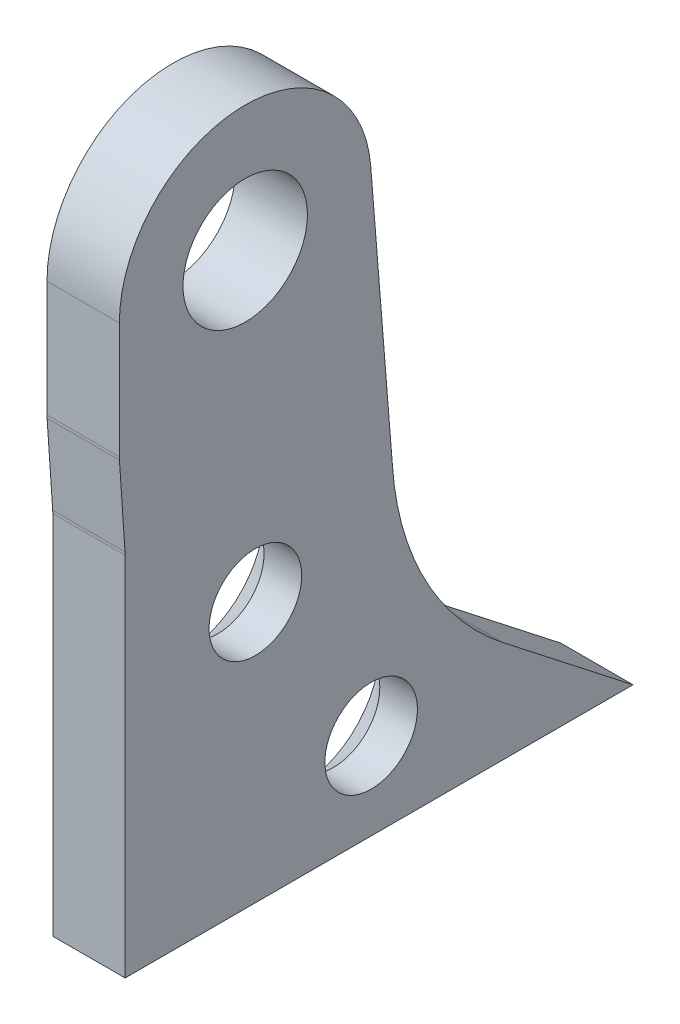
ISO-10303-21;
HEADER;
FILE_DESCRIPTION(('STEP AP214'),'2;1');
FILE_NAME('part.step','',(''),(''),'','','');
FILE_SCHEMA(('AUTOMOTIVE_DESIGN { 1 0 10303 214 1 1 1 1 }'));
ENDSEC;
DATA;
#1=APPLICATION_CONTEXT('core data for automotive mechanical design processes');
#2=APPLICATION_PROTOCOL_DEFINITION('international standard','automotive_design',2000,#1);
#3=PRODUCT_CONTEXT('',#1,'mechanical');
#4=PRODUCT('Part','Part','',(#3));
#5=PRODUCT_RELATED_PRODUCT_CATEGORY('part','',(#4));
#6=PRODUCT_DEFINITION_FORMATION('','',#4);
#7=PRODUCT_DEFINITION_CONTEXT('part definition',#1,'design');
#8=PRODUCT_DEFINITION('design','',#6,#7);
#9=PRODUCT_DEFINITION_SHAPE('','',#8);
#10=(LENGTH_UNIT() NAMED_UNIT(*) SI_UNIT(.MILLI.,.METRE.));
#11=(NAMED_UNIT(*) PLANE_ANGLE_UNIT() SI_UNIT($,.RADIAN.));
#12=(NAMED_UNIT(*) SI_UNIT($,.STERADIAN.) SOLID_ANGLE_UNIT());
#13=UNCERTAINTY_MEASURE_WITH_UNIT(LENGTH_MEASURE(1.E-05),#10,'distance_accuracy_value','');
#14=(GEOMETRIC_REPRESENTATION_CONTEXT(3) GLOBAL_UNCERTAINTY_ASSIGNED_CONTEXT((#13)) GLOBAL_UNIT_ASSIGNED_CONTEXT((#10,
#11,#12)) REPRESENTATION_CONTEXT('',''));
#15=CARTESIAN_POINT('',(0.,0.,0.));
#16=DIRECTION('',(0.,0.,1.));
#17=DIRECTION('',(1.,0.,0.));
#18=AXIS2_PLACEMENT_3D('',#15,#16,#17);
#19=CARTESIAN_POINT('',(-1.25,0.,0.));
#20=DIRECTION('',(-1.,0.,0.));
#21=DIRECTION('',(0.,0.,-1.));
#22=AXIS2_PLACEMENT_3D('',#19,#20,#21);
#23=PLANE('',#22);
#24=CARTESIAN_POINT('',(-1.25,-16.7,-4.35));
#25=DIRECTION('',(1.,0.,0.));
#26=DIRECTION('',(0.,0.,-1.));
#27=AXIS2_PLACEMENT_3D('',#24,#25,#26);
#28=CIRCLE('',#27,2.80000000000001);
#29=CARTESIAN_POINT('',(-1.25,-16.7,-7.15000000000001));
#30=VERTEX_POINT('',#29);
#31=EDGE_CURVE('E208',#30,#30,#28,.F.);
#32=ORIENTED_EDGE('',*,*,#31,.F.);
#33=EDGE_LOOP('',(#32));
#34=FACE_BOUND('',#33,.T.);
#35=CARTESIAN_POINT('',(-1.25,-10.7,-0.35));
#36=DIRECTION('',(1.,0.,0.));
#37=DIRECTION('',(0.,0.,-1.));
#38=AXIS2_PLACEMENT_3D('',#35,#36,#37);
#39=CIRCLE('',#38,2.80000000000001);
#40=CARTESIAN_POINT('',(-1.25,-10.7,-3.15000000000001));
#41=VERTEX_POINT('',#40);
#42=EDGE_CURVE('E205',#41,#41,#39,.F.);
#43=ORIENTED_EDGE('',*,*,#42,.F.);
#44=EDGE_LOOP('',(#43));
#45=FACE_BOUND('',#44,.T.);
#46=DIRECTION('',(0.,0.,1.));
#47=VECTOR('',#46,1.);
#48=CARTESIAN_POINT('',(-1.25,-19.7,4.15));
#49=LINE('',#48,#47);
#50=CARTESIAN_POINT('',(-1.25,-19.7,-13.3978945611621));
#51=VERTEX_POINT('',#50);
#52=CARTESIAN_POINT('',(-1.25,-19.7,4.15));
#53=VERTEX_POINT('',#52);
#54=EDGE_CURVE('E120',#51,#53,#49,.T.);
#55=ORIENTED_EDGE('',*,*,#54,.T.);
#56=DIRECTION('',(0.,-1.,0.));
#57=VECTOR('',#56,1.);
#58=CARTESIAN_POINT('',(-1.25,-7.05080295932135,4.15));
#59=LINE('',#58,#57);
#60=CARTESIAN_POINT('',(-1.25,-7.05080295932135,4.15));
#61=VERTEX_POINT('',#60);
#62=EDGE_CURVE('E169',#61,#53,#59,.T.);
#63=ORIENTED_EDGE('',*,*,#62,.F.);
#64=CARTESIAN_POINT('',(-1.25,-7.05080295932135,5.65));
#65=DIRECTION('',(-1.,0.,0.));
#66=DIRECTION('',(0.,0.,-1.));
#67=AXIS2_PLACEMENT_3D('',#64,#65,#66);
#68=CIRCLE('',#67,1.5);
#69=CARTESIAN_POINT('',(-1.25,-6.94931345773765,4.153437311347));
#70=VERTEX_POINT('',#69);
#71=EDGE_CURVE('E166',#70,#61,#68,.T.);
#72=ORIENTED_EDGE('',*,*,#71,.F.);
#73=DIRECTION('',(0.,-0.997708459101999,-0.0676596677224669));
#74=VECTOR('',#73,1.);
#75=CARTESIAN_POINT('',(-1.25,-4.1014895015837,4.346562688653));
#76=LINE('',#75,#74);
#77=CARTESIAN_POINT('',(-1.25,-4.1014895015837,4.346562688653));
#78=VERTEX_POINT('',#77);
#79=EDGE_CURVE('E163',#78,#70,#76,.T.);
#80=ORIENTED_EDGE('',*,*,#79,.F.);
#81=CARTESIAN_POINT('',(-1.25,-4.,2.85));
#82=DIRECTION('',(1.,0.,0.));
#83=DIRECTION('',(0.,0.,-1.));
#84=AXIS2_PLACEMENT_3D('',#81,#82,#83);
#85=CIRCLE('',#84,1.5);
#86=CARTESIAN_POINT('',(-1.25,-4.,4.35));
#87=VERTEX_POINT('',#86);
#88=EDGE_CURVE('E160',#87,#78,#85,.T.);
#89=ORIENTED_EDGE('',*,*,#88,.F.);
#90=DIRECTION('',(0.,-1.,0.));
#91=VECTOR('',#90,1.);
#92=CARTESIAN_POINT('',(-1.25,0.,4.35));
#93=LINE('',#92,#91);
#94=CARTESIAN_POINT('',(-1.25,0.,4.35));
#95=VERTEX_POINT('',#94);
#96=EDGE_CURVE('E156',#95,#87,#93,.T.);
#97=ORIENTED_EDGE('',*,*,#96,.F.);
#98=CARTESIAN_POINT('',(-1.25,0.,0.));
#99=DIRECTION('',(1.,0.,0.));
#100=DIRECTION('',(0.,0.,-1.));
#101=AXIS2_PLACEMENT_3D('',#98,#99,#100);
#102=CIRCLE('',#101,4.35);
#103=CARTESIAN_POINT('',(-1.25,0.348531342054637,-4.33601497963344));
#104=VERTEX_POINT('',#103);
#105=EDGE_CURVE('E153',#104,#95,#102,.T.);
#106=ORIENTED_EDGE('',*,*,#105,.F.);
#107=DIRECTION('',(0.,0.996785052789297,0.0801221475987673));
#108=VECTOR('',#107,1.);
#109=CARTESIAN_POINT('',(-1.25,-12.8120622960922,-5.39387095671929));
#110=LINE('',#109,#108);
#111=CARTESIAN_POINT('',(-1.25,-8.98239612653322,-5.08604021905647));
#112=VERTEX_POINT('',#111);
#113=EDGE_CURVE('E172',#112,#104,#110,.T.);
#114=ORIENTED_EDGE('',*,*,#113,.F.);
#115=CARTESIAN_POINT('',(-1.25,-8.31111904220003,-15.0634841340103));
#116=DIRECTION('',(1.,0.,0.));
#117=DIRECTION('',(0.,0.,-1.));
#118=AXIS2_PLACEMENT_3D('',#115,#116,#117);
#119=CIRCLE('',#118,10.);
#120=CARTESIAN_POINT('',(-1.25,-16.1912265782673,-8.90686938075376));
#121=VERTEX_POINT('',#120);
#122=EDGE_CURVE('E47',#121,#112,#119,.F.);
#123=ORIENTED_EDGE('',*,*,#122,.F.);
#124=DIRECTION('',(0.,-0.615661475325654,-0.788010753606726));
#125=VECTOR('',#124,1.);
#126=CARTESIAN_POINT('',(-1.25,-19.7,-13.3978945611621));
#127=LINE('',#126,#125);
#128=EDGE_CURVE('E141',#121,#51,#127,.T.);
#129=ORIENTED_EDGE('',*,*,#128,.T.);
#130=EDGE_LOOP('',(#55,#63,#72,#80,#89,#97,#106,#114,#123,#129));
#131=FACE_BOUND('',#130,.T.);
#132=CARTESIAN_POINT('',(-1.25,0.,0.));
#133=DIRECTION('',(1.,0.,0.));
#134=DIRECTION('',(0.,0.,-1.));
#135=AXIS2_PLACEMENT_3D('',#132,#133,#134);
#136=CIRCLE('',#135,2.15);
#137=CARTESIAN_POINT('',(-1.25,0.,-2.15));
#138=VERTEX_POINT('',#137);
#139=EDGE_CURVE('E147',#138,#138,#136,.T.);
#140=ORIENTED_EDGE('',*,*,#139,.T.);
#141=EDGE_LOOP('',(#140));
#142=FACE_BOUND('',#141,.T.);
#143=ADVANCED_FACE('F39',(#34,#45,#131,#142),#23,.T.);
#144=CARTESIAN_POINT('',(1.25,0.,0.));
#145=DIRECTION('',(-1.,0.,0.));
#146=DIRECTION('',(0.,0.,-1.));
#147=AXIS2_PLACEMENT_3D('',#144,#145,#146);
#148=PLANE('',#147);
#149=CARTESIAN_POINT('',(1.25,-16.7,-4.35));
#150=DIRECTION('',(1.,0.,0.));
#151=DIRECTION('',(0.,0.,-1.));
#152=AXIS2_PLACEMENT_3D('',#149,#150,#151);
#153=CIRCLE('',#152,1.6);
#154=CARTESIAN_POINT('',(1.25,-16.7,-5.95));
#155=VERTEX_POINT('',#154);
#156=EDGE_CURVE('E286',#155,#155,#153,.T.);
#157=ORIENTED_EDGE('',*,*,#156,.F.);
#158=EDGE_LOOP('',(#157));
#159=FACE_BOUND('',#158,.T.);
#160=CARTESIAN_POINT('',(1.25,-10.7,-0.35));
#161=DIRECTION('',(1.,0.,0.));
#162=DIRECTION('',(0.,0.,-1.));
#163=AXIS2_PLACEMENT_3D('',#160,#161,#162);
#164=CIRCLE('',#163,1.6);
#165=CARTESIAN_POINT('',(1.25,-10.7,-1.95));
#166=VERTEX_POINT('',#165);
#167=EDGE_CURVE('E143',#166,#166,#164,.T.);
#168=ORIENTED_EDGE('',*,*,#167,.F.);
#169=EDGE_LOOP('',(#168));
#170=FACE_BOUND('',#169,.T.);
#171=DIRECTION('',(0.,0.996785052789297,0.0801221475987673));
#172=VECTOR('',#171,1.);
#173=CARTESIAN_POINT('',(1.25,-12.8120622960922,-5.39387095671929));
#174=LINE('',#173,#172);
#175=CARTESIAN_POINT('',(1.25,-8.98239612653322,-5.08604021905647));
#176=VERTEX_POINT('',#175);
#177=CARTESIAN_POINT('',(1.25,0.348531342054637,-4.33601497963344));
#178=VERTEX_POINT('',#177);
#179=EDGE_CURVE('E157',#176,#178,#174,.T.);
#180=ORIENTED_EDGE('',*,*,#179,.T.);
#181=CARTESIAN_POINT('',(1.25,0.,0.));
#182=DIRECTION('',(1.,0.,0.));
#183=DIRECTION('',(0.,0.,-1.));
#184=AXIS2_PLACEMENT_3D('',#181,#182,#183);
#185=CIRCLE('',#184,4.35);
#186=CARTESIAN_POINT('',(1.25,0.,4.35));
#187=VERTEX_POINT('',#186);
#188=EDGE_CURVE('E150',#178,#187,#185,.T.);
#189=ORIENTED_EDGE('',*,*,#188,.T.);
#190=DIRECTION('',(0.,-1.,0.));
#191=VECTOR('',#190,1.);
#192=CARTESIAN_POINT('',(1.25,0.,4.35));
#193=LINE('',#192,#191);
#194=CARTESIAN_POINT('',(1.25,-4.,4.35));
#195=VERTEX_POINT('',#194);
#196=EDGE_CURVE('E178',#187,#195,#193,.T.);
#197=ORIENTED_EDGE('',*,*,#196,.T.);
#198=CARTESIAN_POINT('',(1.25,-4.,2.85));
#199=DIRECTION('',(1.,0.,0.));
#200=DIRECTION('',(0.,0.,-1.));
#201=AXIS2_PLACEMENT_3D('',#198,#199,#200);
#202=CIRCLE('',#201,1.5);
#203=CARTESIAN_POINT('',(1.25,-4.1014895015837,4.346562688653));
#204=VERTEX_POINT('',#203);
#205=EDGE_CURVE('E181',#195,#204,#202,.T.);
#206=ORIENTED_EDGE('',*,*,#205,.T.);
#207=DIRECTION('',(0.,-0.997708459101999,-0.0676596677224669));
#208=VECTOR('',#207,1.);
#209=CARTESIAN_POINT('',(1.25,-4.1014895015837,4.346562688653));
#210=LINE('',#209,#208);
#211=CARTESIAN_POINT('',(1.25,-6.94931345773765,4.153437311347));
#212=VERTEX_POINT('',#211);
#213=EDGE_CURVE('E184',#204,#212,#210,.T.);
#214=ORIENTED_EDGE('',*,*,#213,.T.);
#215=CARTESIAN_POINT('',(1.25,-7.05080295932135,5.65));
#216=DIRECTION('',(-1.,0.,0.));
#217=DIRECTION('',(0.,0.,-1.));
#218=AXIS2_PLACEMENT_3D('',#215,#216,#217);
#219=CIRCLE('',#218,1.5);
#220=CARTESIAN_POINT('',(1.25,-7.05080295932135,4.15));
#221=VERTEX_POINT('',#220);
#222=EDGE_CURVE('E187',#212,#221,#219,.T.);
#223=ORIENTED_EDGE('',*,*,#222,.T.);
#224=DIRECTION('',(0.,-1.,0.));
#225=VECTOR('',#224,1.);
#226=CARTESIAN_POINT('',(1.25,-7.05080295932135,4.15));
#227=LINE('',#226,#225);
#228=CARTESIAN_POINT('',(1.25,-19.7,4.15));
#229=VERTEX_POINT('',#228);
#230=EDGE_CURVE('E136',#221,#229,#227,.T.);
#231=ORIENTED_EDGE('',*,*,#230,.T.);
#232=DIRECTION('',(0.,0.,1.));
#233=VECTOR('',#232,1.);
#234=CARTESIAN_POINT('',(1.25,-19.7,4.15));
#235=LINE('',#234,#233);
#236=CARTESIAN_POINT('',(1.25,-19.7,-13.3978945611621));
#237=VERTEX_POINT('',#236);
#238=EDGE_CURVE('E117',#237,#229,#235,.T.);
#239=ORIENTED_EDGE('',*,*,#238,.F.);
#240=DIRECTION('',(0.,-0.615661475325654,-0.788010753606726));
#241=VECTOR('',#240,1.);
#242=CARTESIAN_POINT('',(1.25,-19.7,-13.3978945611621));
#243=LINE('',#242,#241);
#244=CARTESIAN_POINT('',(1.25,-16.1912265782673,-8.90686938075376));
#245=VERTEX_POINT('',#244);
#246=EDGE_CURVE('E126',#245,#237,#243,.T.);
#247=ORIENTED_EDGE('',*,*,#246,.F.);
#248=CARTESIAN_POINT('',(1.25,-8.31111904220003,-15.0634841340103));
#249=DIRECTION('',(1.,0.,0.));
#250=DIRECTION('',(0.,0.,-1.));
#251=AXIS2_PLACEMENT_3D('',#248,#249,#250);
#252=CIRCLE('',#251,10.);
#253=EDGE_CURVE('E11',#176,#245,#252,.T.);
#254=ORIENTED_EDGE('',*,*,#253,.F.);
#255=EDGE_LOOP('',(#180,#189,#197,#206,#214,#223,#231,#239,#247,#254));
#256=FACE_BOUND('',#255,.T.);
#257=CARTESIAN_POINT('',(1.25,0.,0.));
#258=DIRECTION('',(1.,0.,0.));
#259=DIRECTION('',(0.,0.,-1.));
#260=AXIS2_PLACEMENT_3D('',#257,#258,#259);
#261=CIRCLE('',#260,2.15);
#262=CARTESIAN_POINT('',(1.25,0.,-2.15));
#263=VERTEX_POINT('',#262);
#264=EDGE_CURVE('E145',#263,#263,#261,.T.);
#265=ORIENTED_EDGE('',*,*,#264,.F.);
#266=EDGE_LOOP('',(#265));
#267=FACE_BOUND('',#266,.T.);
#268=ADVANCED_FACE('F132',(#159,#170,#256,#267),#148,.F.);
#269=CARTESIAN_POINT('',(-1.25,0.,0.));
#270=DIRECTION('',(1.,0.,0.));
#271=DIRECTION('',(0.,0.,1.));
#272=AXIS2_PLACEMENT_3D('',#269,#270,#271);
#273=CYLINDRICAL_SURFACE('',#272,4.35);
#274=ORIENTED_EDGE('',*,*,#188,.F.);
#275=DIRECTION('',(1.,0.,0.));
#276=VECTOR('',#275,1.);
#277=CARTESIAN_POINT('',(-1.25,0.348531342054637,-4.33601497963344));
#278=LINE('',#277,#276);
#279=EDGE_CURVE('E175',#104,#178,#278,.T.);
#280=ORIENTED_EDGE('',*,*,#279,.F.);
#281=ORIENTED_EDGE('',*,*,#105,.T.);
#282=DIRECTION('',(1.,0.,0.));
#283=VECTOR('',#282,1.);
#284=CARTESIAN_POINT('',(-1.25,0.,4.35));
#285=LINE('',#284,#283);
#286=EDGE_CURVE('E200',#95,#187,#285,.T.);
#287=ORIENTED_EDGE('',*,*,#286,.T.);
#288=EDGE_LOOP('',(#274,#280,#281,#287));
#289=FACE_BOUND('',#288,.T.);
#290=ADVANCED_FACE('F226',(#289),#273,.T.);
#291=CARTESIAN_POINT('',(-1.25,0.,4.35));
#292=DIRECTION('',(0.,0.,-1.));
#293=DIRECTION('',(0.,1.,0.));
#294=AXIS2_PLACEMENT_3D('',#291,#292,#293);
#295=PLANE('',#294);
#296=ORIENTED_EDGE('',*,*,#196,.F.);
#297=ORIENTED_EDGE('',*,*,#286,.F.);
#298=ORIENTED_EDGE('',*,*,#96,.T.);
#299=DIRECTION('',(1.,0.,0.));
#300=VECTOR('',#299,1.);
#301=CARTESIAN_POINT('',(-1.25,-4.,4.35));
#302=LINE('',#301,#300);
#303=EDGE_CURVE('E198',#87,#195,#302,.T.);
#304=ORIENTED_EDGE('',*,*,#303,.T.);
#305=EDGE_LOOP('',(#296,#297,#298,#304));
#306=FACE_BOUND('',#305,.T.);
#307=ADVANCED_FACE('F228',(#306),#295,.F.);
#308=CARTESIAN_POINT('',(-1.25,-4.,2.85));
#309=DIRECTION('',(1.,0.,0.));
#310=DIRECTION('',(0.,0.,1.));
#311=AXIS2_PLACEMENT_3D('',#308,#309,#310);
#312=CYLINDRICAL_SURFACE('',#311,1.5);
#313=ORIENTED_EDGE('',*,*,#205,.F.);
#314=ORIENTED_EDGE('',*,*,#303,.F.);
#315=ORIENTED_EDGE('',*,*,#88,.T.);
#316=DIRECTION('',(1.,0.,0.));
#317=VECTOR('',#316,1.);
#318=CARTESIAN_POINT('',(-1.25,-4.1014895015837,4.346562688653));
#319=LINE('',#318,#317);
#320=EDGE_CURVE('E196',#78,#204,#319,.T.);
#321=ORIENTED_EDGE('',*,*,#320,.T.);
#322=EDGE_LOOP('',(#313,#314,#315,#321));
#323=FACE_BOUND('',#322,.T.);
#324=ADVANCED_FACE('F232',(#323),#312,.T.);
#325=CARTESIAN_POINT('',(-1.25,-4.1014895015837,4.346562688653));
#326=DIRECTION('',(0.,0.0676596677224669,-0.997708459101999));
#327=DIRECTION('',(0.,0.997708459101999,0.0676596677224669));
#328=AXIS2_PLACEMENT_3D('',#325,#326,#327);
#329=PLANE('',#328);
#330=ORIENTED_EDGE('',*,*,#213,.F.);
#331=ORIENTED_EDGE('',*,*,#320,.F.);
#332=ORIENTED_EDGE('',*,*,#79,.T.);
#333=DIRECTION('',(1.,0.,0.));
#334=VECTOR('',#333,1.);
#335=CARTESIAN_POINT('',(-1.25,-6.94931345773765,4.153437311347));
#336=LINE('',#335,#334);
#337=EDGE_CURVE('E194',#70,#212,#336,.T.);
#338=ORIENTED_EDGE('',*,*,#337,.T.);
#339=EDGE_LOOP('',(#330,#331,#332,#338));
#340=FACE_BOUND('',#339,.T.);
#341=ADVANCED_FACE('F236',(#340),#329,.F.);
#342=CARTESIAN_POINT('',(-1.25,-7.05080295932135,5.65));
#343=DIRECTION('',(1.,0.,0.));
#344=DIRECTION('',(0.,0.,1.));
#345=AXIS2_PLACEMENT_3D('',#342,#343,#344);
#346=CYLINDRICAL_SURFACE('',#345,1.5);
#347=ORIENTED_EDGE('',*,*,#222,.F.);
#348=ORIENTED_EDGE('',*,*,#337,.F.);
#349=ORIENTED_EDGE('',*,*,#71,.T.);
#350=DIRECTION('',(1.,0.,0.));
#351=VECTOR('',#350,1.);
#352=CARTESIAN_POINT('',(-1.25,-7.05080295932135,4.15));
#353=LINE('',#352,#351);
#354=EDGE_CURVE('E192',#61,#221,#353,.T.);
#355=ORIENTED_EDGE('',*,*,#354,.T.);
#356=EDGE_LOOP('',(#347,#348,#349,#355));
#357=FACE_BOUND('',#356,.T.);
#358=ADVANCED_FACE('F240',(#357),#346,.F.);
#359=CARTESIAN_POINT('',(-1.25,-7.05080295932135,4.15));
#360=DIRECTION('',(0.,0.,-1.));
#361=DIRECTION('',(0.,1.,0.));
#362=AXIS2_PLACEMENT_3D('',#359,#360,#361);
#363=PLANE('',#362);
#364=ORIENTED_EDGE('',*,*,#230,.F.);
#365=ORIENTED_EDGE('',*,*,#354,.F.);
#366=ORIENTED_EDGE('',*,*,#62,.T.);
#367=DIRECTION('',(-1.,0.,0.));
#368=VECTOR('',#367,1.);
#369=CARTESIAN_POINT('',(1.25,-19.7,4.15));
#370=LINE('',#369,#368);
#371=EDGE_CURVE('E122',#229,#53,#370,.T.);
#372=ORIENTED_EDGE('',*,*,#371,.F.);
#373=EDGE_LOOP('',(#364,#365,#366,#372));
#374=FACE_BOUND('',#373,.T.);
#375=ADVANCED_FACE('F243',(#374),#363,.F.);
#376=CARTESIAN_POINT('',(-1.25,-12.8120622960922,-5.39387095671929));
#377=DIRECTION('',(0.,-0.0801221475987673,0.996785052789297));
#378=DIRECTION('',(0.,-0.996785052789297,-0.0801221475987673));
#379=AXIS2_PLACEMENT_3D('',#376,#377,#378);
#380=PLANE('',#379);
#381=ORIENTED_EDGE('',*,*,#113,.T.);
#382=ORIENTED_EDGE('',*,*,#279,.T.);
#383=ORIENTED_EDGE('',*,*,#179,.F.);
#384=DIRECTION('',(-1.,0.,0.));
#385=VECTOR('',#384,1.);
#386=CARTESIAN_POINT('',(1.25,-8.98239612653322,-5.08604021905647));
#387=LINE('',#386,#385);
#388=EDGE_CURVE('E123',#176,#112,#387,.T.);
#389=ORIENTED_EDGE('',*,*,#388,.T.);
#390=EDGE_LOOP('',(#381,#382,#383,#389));
#391=FACE_BOUND('',#390,.T.);
#392=ADVANCED_FACE('F221',(#391),#380,.F.);
#393=CARTESIAN_POINT('',(-1.25,0.,0.));
#394=DIRECTION('',(1.,0.,0.));
#395=DIRECTION('',(0.,0.,1.));
#396=AXIS2_PLACEMENT_3D('',#393,#394,#395);
#397=CYLINDRICAL_SURFACE('',#396,2.15);
#398=ORIENTED_EDGE('',*,*,#139,.F.);
#399=EDGE_LOOP('',(#398));
#400=FACE_BOUND('',#399,.T.);
#401=ORIENTED_EDGE('',*,*,#264,.T.);
#402=EDGE_LOOP('',(#401));
#403=FACE_BOUND('',#402,.T.);
#404=ADVANCED_FACE('F250',(#400,#403),#397,.F.);
#405=CARTESIAN_POINT('',(1.25,-19.7,4.15));
#406=DIRECTION('',(0.,1.,0.));
#407=DIRECTION('',(0.,0.,1.));
#408=AXIS2_PLACEMENT_3D('',#405,#406,#407);
#409=PLANE('',#408);
#410=ORIENTED_EDGE('',*,*,#54,.F.);
#411=DIRECTION('',(-1.,0.,0.));
#412=VECTOR('',#411,1.);
#413=CARTESIAN_POINT('',(1.25,-19.7,-13.3978945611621));
#414=LINE('',#413,#412);
#415=EDGE_CURVE('E114',#237,#51,#414,.T.);
#416=ORIENTED_EDGE('',*,*,#415,.F.);
#417=ORIENTED_EDGE('',*,*,#238,.T.);
#418=ORIENTED_EDGE('',*,*,#371,.T.);
#419=EDGE_LOOP('',(#410,#416,#417,#418));
#420=FACE_BOUND('',#419,.T.);
#421=ADVANCED_FACE('F115',(#420),#409,.F.);
#422=CARTESIAN_POINT('',(1.25,-19.7,-13.3978945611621));
#423=DIRECTION('',(0.,-0.788010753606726,0.615661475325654));
#424=DIRECTION('',(0.,-0.615661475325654,-0.788010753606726));
#425=AXIS2_PLACEMENT_3D('',#422,#423,#424);
#426=PLANE('',#425);
#427=ORIENTED_EDGE('',*,*,#246,.T.);
#428=ORIENTED_EDGE('',*,*,#415,.T.);
#429=ORIENTED_EDGE('',*,*,#128,.F.);
#430=DIRECTION('',(-1.,0.,0.));
#431=VECTOR('',#430,1.);
#432=CARTESIAN_POINT('',(1.25,-16.1912265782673,-8.90686938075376));
#433=LINE('',#432,#431);
#434=EDGE_CURVE('E54',#245,#121,#433,.T.);
#435=ORIENTED_EDGE('',*,*,#434,.F.);
#436=EDGE_LOOP('',(#427,#428,#429,#435));
#437=FACE_BOUND('',#436,.T.);
#438=ADVANCED_FACE('F127',(#437),#426,.F.);
#439=CARTESIAN_POINT('',(1.25,-10.7,-0.35));
#440=DIRECTION('',(-1.,0.,0.));
#441=DIRECTION('',(0.,0.,-1.));
#442=AXIS2_PLACEMENT_3D('',#439,#440,#441);
#443=CYLINDRICAL_SURFACE('',#442,1.6);
#444=CARTESIAN_POINT('',(-0.0499999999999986,-10.7,-0.35));
#445=DIRECTION('',(1.,0.,0.));
#446=DIRECTION('',(0.,0.,-1.));
#447=AXIS2_PLACEMENT_3D('',#444,#445,#446);
#448=CIRCLE('',#447,1.6);
#449=CARTESIAN_POINT('',(-0.0499999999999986,-10.7,-1.95));
#450=VERTEX_POINT('',#449);
#451=EDGE_CURVE('E211',#450,#450,#448,.T.);
#452=ORIENTED_EDGE('',*,*,#451,.F.);
#453=EDGE_LOOP('',(#452));
#454=FACE_BOUND('',#453,.T.);
#455=ORIENTED_EDGE('',*,*,#167,.T.);
#456=EDGE_LOOP('',(#455));
#457=FACE_BOUND('',#456,.T.);
#458=ADVANCED_FACE('F269',(#454,#457),#443,.F.);
#459=CARTESIAN_POINT('',(1.25,-16.7,-4.35));
#460=DIRECTION('',(-1.,0.,0.));
#461=DIRECTION('',(0.,0.,-1.));
#462=AXIS2_PLACEMENT_3D('',#459,#460,#461);
#463=CYLINDRICAL_SURFACE('',#462,1.6);
#464=CARTESIAN_POINT('',(-0.0499999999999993,-16.7,-4.35));
#465=DIRECTION('',(1.,0.,0.));
#466=DIRECTION('',(0.,0.,-1.));
#467=AXIS2_PLACEMENT_3D('',#464,#465,#466);
#468=CIRCLE('',#467,1.6);
#469=CARTESIAN_POINT('',(-0.0499999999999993,-16.7,-5.95));
#470=VERTEX_POINT('',#469);
#471=EDGE_CURVE('E202',#470,#470,#468,.T.);
#472=ORIENTED_EDGE('',*,*,#471,.F.);
#473=EDGE_LOOP('',(#472));
#474=FACE_BOUND('',#473,.T.);
#475=ORIENTED_EDGE('',*,*,#156,.T.);
#476=EDGE_LOOP('',(#475));
#477=FACE_BOUND('',#476,.T.);
#478=ADVANCED_FACE('F272',(#474,#477),#463,.F.);
#479=CARTESIAN_POINT('',(-0.0499999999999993,-16.7,-4.35));
#480=DIRECTION('',(-1.,0.,0.));
#481=DIRECTION('',(0.,0.,-1.));
#482=AXIS2_PLACEMENT_3D('',#479,#480,#481);
#483=CONICAL_SURFACE('',#482,1.6,0.78539816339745);
#484=ORIENTED_EDGE('',*,*,#31,.T.);
#485=EDGE_LOOP('',(#484));
#486=FACE_BOUND('',#485,.T.);
#487=ORIENTED_EDGE('',*,*,#471,.T.);
#488=EDGE_LOOP('',(#487));
#489=FACE_BOUND('',#488,.T.);
#490=ADVANCED_FACE('F275',(#486,#489),#483,.F.);
#491=CARTESIAN_POINT('',(-0.0499999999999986,-10.7,-0.35));
#492=DIRECTION('',(-1.,0.,0.));
#493=DIRECTION('',(0.,0.,-1.));
#494=AXIS2_PLACEMENT_3D('',#491,#492,#493);
#495=CONICAL_SURFACE('',#494,1.6,0.78539816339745);
#496=ORIENTED_EDGE('',*,*,#42,.T.);
#497=EDGE_LOOP('',(#496));
#498=FACE_BOUND('',#497,.T.);
#499=ORIENTED_EDGE('',*,*,#451,.T.);
#500=EDGE_LOOP('',(#499));
#501=FACE_BOUND('',#500,.T.);
#502=ADVANCED_FACE('F292',(#498,#501),#495,.F.);
#503=CARTESIAN_POINT('',(1.25,-8.31111904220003,-15.0634841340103));
#504=DIRECTION('',(-1.,0.,0.));
#505=DIRECTION('',(0.,0.,-1.));
#506=AXIS2_PLACEMENT_3D('',#503,#504,#505);
#507=CYLINDRICAL_SURFACE('',#506,10.);
#508=ORIENTED_EDGE('',*,*,#253,.T.);
#509=ORIENTED_EDGE('',*,*,#434,.T.);
#510=ORIENTED_EDGE('',*,*,#122,.T.);
#511=ORIENTED_EDGE('',*,*,#388,.F.);
#512=EDGE_LOOP('',(#508,#509,#510,#511));
#513=FACE_BOUND('',#512,.T.);
#514=ADVANCED_FACE('F41',(#513),#507,.F.);
#515=CLOSED_SHELL('',(#143,#268,#290,#307,#324,#341,#358,#375,#392,#404,#421,#438,#458,#478,
#490,#502,#514));
#516=MANIFOLD_SOLID_BREP('B2',#515);
#517=ADVANCED_BREP_SHAPE_REPRESENTATION('',(#18,#516),#14);
#518=SHAPE_DEFINITION_REPRESENTATION(#9,#517);
ENDSEC;
END-ISO-10303-21;
